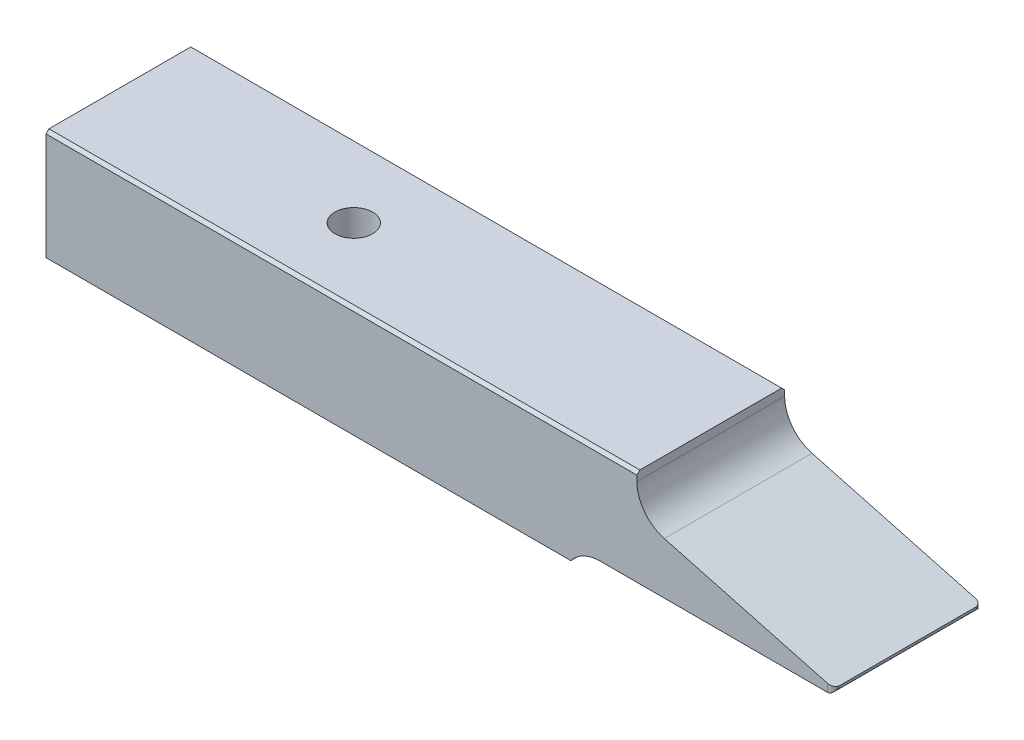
ISO-10303-21;
HEADER;
FILE_DESCRIPTION(('STEP AP214'),'2;1');
FILE_NAME('part.step','',(''),(''),'','','');
FILE_SCHEMA(('AUTOMOTIVE_DESIGN { 1 0 10303 214 1 1 1 1 }'));
ENDSEC;
DATA;
#1=APPLICATION_CONTEXT('core data for automotive mechanical design processes');
#2=APPLICATION_PROTOCOL_DEFINITION('international standard','automotive_design',2000,#1);
#3=PRODUCT_CONTEXT('',#1,'mechanical');
#4=PRODUCT('Part','Part','',(#3));
#5=PRODUCT_RELATED_PRODUCT_CATEGORY('part','',(#4));
#6=PRODUCT_DEFINITION_FORMATION('','',#4);
#7=PRODUCT_DEFINITION_CONTEXT('part definition',#1,'design');
#8=PRODUCT_DEFINITION('design','',#6,#7);
#9=PRODUCT_DEFINITION_SHAPE('','',#8);
#10=(LENGTH_UNIT() NAMED_UNIT(*) SI_UNIT(.MILLI.,.METRE.));
#11=(NAMED_UNIT(*) PLANE_ANGLE_UNIT() SI_UNIT($,.RADIAN.));
#12=(NAMED_UNIT(*) SI_UNIT($,.STERADIAN.) SOLID_ANGLE_UNIT());
#13=UNCERTAINTY_MEASURE_WITH_UNIT(LENGTH_MEASURE(1.E-05),#10,'distance_accuracy_value','');
#14=(GEOMETRIC_REPRESENTATION_CONTEXT(3) GLOBAL_UNCERTAINTY_ASSIGNED_CONTEXT((#13)) GLOBAL_UNIT_ASSIGNED_CONTEXT((#10,
#11,#12)) REPRESENTATION_CONTEXT('',''));
#15=CARTESIAN_POINT('',(0.,0.,0.));
#16=DIRECTION('',(0.,0.,1.));
#17=DIRECTION('',(1.,0.,0.));
#18=AXIS2_PLACEMENT_3D('',#15,#16,#17);
#19=CARTESIAN_POINT('',(101.6,2.63525,-9.525));
#20=DIRECTION('',(0.258819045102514,0.96592582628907,0.));
#21=DIRECTION('',(-0.96592582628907,0.258819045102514,0.));
#22=AXIS2_PLACEMENT_3D('',#19,#20,#21);
#23=PLANE('',#22);
#24=DIRECTION('',(0.,0.,1.));
#25=VECTOR('',#24,1.);
#26=CARTESIAN_POINT('',(101.6,2.63525,-9.525));
#27=LINE('',#26,#25);
#28=CARTESIAN_POINT('',(101.6,2.63525,-8.73124999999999));
#29=VERTEX_POINT('',#28);
#30=CARTESIAN_POINT('',(101.6,2.63525,8.73124999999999));
#31=VERTEX_POINT('',#30);
#32=EDGE_CURVE('E146',#29,#31,#27,.T.);
#33=ORIENTED_EDGE('',*,*,#32,.F.);
#34=CARTESIAN_POINT('',(100.80625,2.8479346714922,-8.73125));
#35=DIRECTION('',(0.258819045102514,0.96592582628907,0.));
#36=DIRECTION('',(0.96592582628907,-0.258819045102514,0.));
#37=AXIS2_PLACEMENT_3D('',#34,#35,#36);
#38=ELLIPSE('',#37,0.8217504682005,0.793749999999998);
#39=CARTESIAN_POINT('',(100.80625,2.84793467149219,-9.525));
#40=VERTEX_POINT('',#39);
#41=EDGE_CURVE('E260',#29,#40,#38,.T.);
#42=ORIENTED_EDGE('',*,*,#41,.T.);
#43=DIRECTION('',(-0.96592582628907,0.258819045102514,0.));
#44=VECTOR('',#43,1.);
#45=CARTESIAN_POINT('',(101.6,2.63525,-9.525));
#46=LINE('',#45,#44);
#47=CARTESIAN_POINT('',(79.7298742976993,8.49533252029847,-9.525));
#48=VERTEX_POINT('',#47);
#49=EDGE_CURVE('E218',#40,#48,#46,.T.);
#50=ORIENTED_EDGE('',*,*,#49,.T.);
#51=DIRECTION('',(0.,0.,1.));
#52=VECTOR('',#51,1.);
#53=CARTESIAN_POINT('',(79.7298742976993,8.49533252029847,-9.525));
#54=LINE('',#53,#52);
#55=CARTESIAN_POINT('',(79.7298742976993,8.49533252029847,9.525));
#56=VERTEX_POINT('',#55);
#57=EDGE_CURVE('E154',#48,#56,#54,.T.);
#58=ORIENTED_EDGE('',*,*,#57,.T.);
#59=DIRECTION('',(-0.96592582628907,0.258819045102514,0.));
#60=VECTOR('',#59,1.);
#61=CARTESIAN_POINT('',(101.6,2.63525,9.525));
#62=LINE('',#61,#60);
#63=CARTESIAN_POINT('',(100.80625,2.84793467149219,9.525));
#64=VERTEX_POINT('',#63);
#65=EDGE_CURVE('E134',#64,#56,#62,.T.);
#66=ORIENTED_EDGE('',*,*,#65,.F.);
#67=CARTESIAN_POINT('',(100.80625,2.8479346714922,8.73125));
#68=DIRECTION('',(0.258819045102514,0.96592582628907,0.));
#69=DIRECTION('',(0.96592582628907,-0.258819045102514,0.));
#70=AXIS2_PLACEMENT_3D('',#67,#68,#69);
#71=ELLIPSE('',#70,0.8217504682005,0.793749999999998);
#72=EDGE_CURVE('E49',#64,#31,#71,.T.);
#73=ORIENTED_EDGE('',*,*,#72,.T.);
#74=EDGE_LOOP('',(#33,#42,#50,#58,#66,#73));
#75=FACE_BOUND('',#74,.T.);
#76=ADVANCED_FACE('F34',(#75),#23,.T.);
#77=CARTESIAN_POINT('',(100.80625,2.63525,-9.525));
#78=DIRECTION('',(0.,0.,1.));
#79=DIRECTION('',(1.,0.,0.));
#80=AXIS2_PLACEMENT_3D('',#77,#78,#79);
#81=CYLINDRICAL_SURFACE('',#80,0.793749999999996);
#82=DIRECTION('',(0.,0.,1.));
#83=VECTOR('',#82,1.);
#84=CARTESIAN_POINT('',(100.80625,1.8415,-9.525));
#85=LINE('',#84,#83);
#86=CARTESIAN_POINT('',(100.80625,1.8415,-9.525));
#87=VERTEX_POINT('',#86);
#88=CARTESIAN_POINT('',(100.80625,1.8415,9.525));
#89=VERTEX_POINT('',#88);
#90=EDGE_CURVE('E144',#87,#89,#85,.T.);
#91=ORIENTED_EDGE('',*,*,#90,.F.);
#92=CARTESIAN_POINT('',(100.80625,2.63525,-8.73125));
#93=DIRECTION('',(0.,-0.707106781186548,0.707106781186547));
#94=DIRECTION('',(0.,0.707106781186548,0.707106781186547));
#95=AXIS2_PLACEMENT_3D('',#92,#93,#94);
#96=ELLIPSE('',#95,1.12253201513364,0.793749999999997);
#97=EDGE_CURVE('E262',#87,#29,#96,.T.);
#98=ORIENTED_EDGE('',*,*,#97,.T.);
#99=ORIENTED_EDGE('',*,*,#32,.T.);
#100=CARTESIAN_POINT('',(100.80625,2.63525,8.73125));
#101=DIRECTION('',(0.,0.707106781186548,0.707106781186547));
#102=DIRECTION('',(0.,-0.707106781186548,0.707106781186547));
#103=AXIS2_PLACEMENT_3D('',#100,#101,#102);
#104=ELLIPSE('',#103,1.12253201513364,0.793749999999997);
#105=EDGE_CURVE('E138',#31,#89,#104,.F.);
#106=ORIENTED_EDGE('',*,*,#105,.T.);
#107=EDGE_LOOP('',(#91,#98,#99,#106));
#108=FACE_BOUND('',#107,.T.);
#109=ADVANCED_FACE('F142',(#108),#81,.T.);
#110=CARTESIAN_POINT('',(80.9625,13.0955542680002,-9.525));
#111=DIRECTION('',(0.,0.,-1.));
#112=DIRECTION('',(-1.,0.,0.));
#113=AXIS2_PLACEMENT_3D('',#110,#111,#112);
#114=PLANE('',#113);
#115=DIRECTION('',(0.,-1.,0.));
#116=VECTOR('',#115,1.);
#117=CARTESIAN_POINT('',(100.80625,14.1986,-9.525));
#118=LINE('',#117,#116);
#119=EDGE_CURVE('E11',#40,#87,#118,.T.);
#120=ORIENTED_EDGE('',*,*,#119,.T.);
#121=DIRECTION('',(1.,0.,0.));
#122=VECTOR('',#121,1.);
#123=CARTESIAN_POINT('',(71.4375,1.8415,-9.525));
#124=LINE('',#123,#122);
#125=CARTESIAN_POINT('',(71.4375,1.8415,-9.525));
#126=VERTEX_POINT('',#125);
#127=EDGE_CURVE('E150',#126,#87,#124,.T.);
#128=ORIENTED_EDGE('',*,*,#127,.F.);
#129=CARTESIAN_POINT('',(71.4375,-2.921,-9.525));
#130=DIRECTION('',(0.,0.,-1.));
#131=DIRECTION('',(1.,0.,0.));
#132=AXIS2_PLACEMENT_3D('',#129,#130,#131);
#133=CIRCLE('',#132,4.7625);
#134=CARTESIAN_POINT('',(67.6759623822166,0.,-9.525));
#135=VERTEX_POINT('',#134);
#136=EDGE_CURVE('E227',#135,#126,#133,.T.);
#137=ORIENTED_EDGE('',*,*,#136,.F.);
#138=DIRECTION('',(1.,0.,0.));
#139=VECTOR('',#138,1.);
#140=CARTESIAN_POINT('',(67.6759623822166,0.,-9.525));
#141=LINE('',#140,#139);
#142=CARTESIAN_POINT('',(0.,0.,-9.525));
#143=VERTEX_POINT('',#142);
#144=EDGE_CURVE('E225',#143,#135,#141,.T.);
#145=ORIENTED_EDGE('',*,*,#144,.F.);
#146=DIRECTION('',(0.,-1.,0.));
#147=VECTOR('',#146,1.);
#148=CARTESIAN_POINT('',(0.,0.,-9.525));
#149=LINE('',#148,#147);
#150=CARTESIAN_POINT('',(0.,13.8176,-9.525));
#151=VERTEX_POINT('',#150);
#152=EDGE_CURVE('E161',#151,#143,#149,.T.);
#153=ORIENTED_EDGE('',*,*,#152,.F.);
#154=DIRECTION('',(1.,0.,0.));
#155=VECTOR('',#154,1.);
#156=CARTESIAN_POINT('',(80.9625,13.8176,-9.525));
#157=LINE('',#156,#155);
#158=CARTESIAN_POINT('',(76.2,13.8176,-9.525));
#159=VERTEX_POINT('',#158);
#160=EDGE_CURVE('E57',#151,#159,#157,.T.);
#161=ORIENTED_EDGE('',*,*,#160,.T.);
#162=DIRECTION('',(0.,1.,0.));
#163=VECTOR('',#162,1.);
#164=CARTESIAN_POINT('',(76.2,14.1986,-9.525));
#165=LINE('',#164,#163);
#166=CARTESIAN_POINT('',(76.2,13.0955542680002,-9.525));
#167=VERTEX_POINT('',#166);
#168=EDGE_CURVE('E242',#167,#159,#165,.T.);
#169=ORIENTED_EDGE('',*,*,#168,.F.);
#170=CARTESIAN_POINT('',(80.9625,13.0955542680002,-9.525));
#171=DIRECTION('',(0.,0.,-1.));
#172=DIRECTION('',(-1.,0.,0.));
#173=AXIS2_PLACEMENT_3D('',#170,#171,#172);
#174=CIRCLE('',#173,4.76249999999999);
#175=EDGE_CURVE('E240',#48,#167,#174,.T.);
#176=ORIENTED_EDGE('',*,*,#175,.F.);
#177=ORIENTED_EDGE('',*,*,#49,.F.);
#178=EDGE_LOOP('',(#120,#128,#137,#145,#153,#161,#169,#176,#177));
#179=FACE_BOUND('',#178,.T.);
#180=ADVANCED_FACE('F265',(#179),#114,.T.);
#181=CARTESIAN_POINT('',(80.9625,13.0955542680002,9.525));
#182=DIRECTION('',(0.,0.,-1.));
#183=DIRECTION('',(-1.,0.,0.));
#184=AXIS2_PLACEMENT_3D('',#181,#182,#183);
#185=PLANE('',#184);
#186=ORIENTED_EDGE('',*,*,#65,.T.);
#187=CARTESIAN_POINT('',(80.9625,13.0955542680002,9.525));
#188=DIRECTION('',(0.,0.,-1.));
#189=DIRECTION('',(-1.,0.,0.));
#190=AXIS2_PLACEMENT_3D('',#187,#188,#189);
#191=CIRCLE('',#190,4.76249999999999);
#192=CARTESIAN_POINT('',(76.2,13.0955542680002,9.525));
#193=VERTEX_POINT('',#192);
#194=EDGE_CURVE('E194',#56,#193,#191,.T.);
#195=ORIENTED_EDGE('',*,*,#194,.T.);
#196=DIRECTION('',(0.,1.,0.));
#197=VECTOR('',#196,1.);
#198=CARTESIAN_POINT('',(76.2,14.1986,9.525));
#199=LINE('',#198,#197);
#200=CARTESIAN_POINT('',(76.2,13.8176,9.525));
#201=VERTEX_POINT('',#200);
#202=EDGE_CURVE('E185',#193,#201,#199,.T.);
#203=ORIENTED_EDGE('',*,*,#202,.T.);
#204=DIRECTION('',(-1.,0.,0.));
#205=VECTOR('',#204,1.);
#206=CARTESIAN_POINT('',(0.,13.8176,9.525));
#207=LINE('',#206,#205);
#208=CARTESIAN_POINT('',(0.,13.8176,9.525));
#209=VERTEX_POINT('',#208);
#210=EDGE_CURVE('E162',#201,#209,#207,.T.);
#211=ORIENTED_EDGE('',*,*,#210,.T.);
#212=DIRECTION('',(0.,-1.,0.));
#213=VECTOR('',#212,1.);
#214=CARTESIAN_POINT('',(0.,0.,9.525));
#215=LINE('',#214,#213);
#216=CARTESIAN_POINT('',(0.,0.,9.525));
#217=VERTEX_POINT('',#216);
#218=EDGE_CURVE('E195',#209,#217,#215,.T.);
#219=ORIENTED_EDGE('',*,*,#218,.T.);
#220=DIRECTION('',(1.,0.,0.));
#221=VECTOR('',#220,1.);
#222=CARTESIAN_POINT('',(67.6759623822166,0.,9.525));
#223=LINE('',#222,#221);
#224=CARTESIAN_POINT('',(67.6759623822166,0.,9.525));
#225=VERTEX_POINT('',#224);
#226=EDGE_CURVE('E245',#217,#225,#223,.T.);
#227=ORIENTED_EDGE('',*,*,#226,.T.);
#228=CARTESIAN_POINT('',(71.4375,-2.921,9.525));
#229=DIRECTION('',(0.,0.,-1.));
#230=DIRECTION('',(1.,0.,0.));
#231=AXIS2_PLACEMENT_3D('',#228,#229,#230);
#232=CIRCLE('',#231,4.7625);
#233=CARTESIAN_POINT('',(71.4375,1.8415,9.525));
#234=VERTEX_POINT('',#233);
#235=EDGE_CURVE('E131',#225,#234,#232,.T.);
#236=ORIENTED_EDGE('',*,*,#235,.T.);
#237=DIRECTION('',(1.,0.,0.));
#238=VECTOR('',#237,1.);
#239=CARTESIAN_POINT('',(71.4375,1.8415,9.525));
#240=LINE('',#239,#238);
#241=EDGE_CURVE('E126',#234,#89,#240,.T.);
#242=ORIENTED_EDGE('',*,*,#241,.T.);
#243=DIRECTION('',(0.,-1.,0.));
#244=VECTOR('',#243,1.);
#245=CARTESIAN_POINT('',(100.80625,14.1986,9.525));
#246=LINE('',#245,#244);
#247=EDGE_CURVE('E42',#64,#89,#246,.T.);
#248=ORIENTED_EDGE('',*,*,#247,.F.);
#249=EDGE_LOOP('',(#186,#195,#203,#211,#219,#227,#236,#242,#248));
#250=FACE_BOUND('',#249,.T.);
#251=ADVANCED_FACE('F127',(#250),#185,.F.);
#252=CARTESIAN_POINT('',(67.6759623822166,0.,-9.525));
#253=DIRECTION('',(0.,-1.,0.));
#254=DIRECTION('',(0.,0.,-1.));
#255=AXIS2_PLACEMENT_3D('',#252,#253,#254);
#256=PLANE('',#255);
#257=CARTESIAN_POINT('',(30.1625,0.,0.));
#258=DIRECTION('',(0.,-1.,0.));
#259=DIRECTION('',(0.,0.,-1.));
#260=AXIS2_PLACEMENT_3D('',#257,#258,#259);
#261=CIRCLE('',#260,2.0193);
#262=CARTESIAN_POINT('',(30.1625,0.,-2.0193));
#263=VERTEX_POINT('',#262);
#264=EDGE_CURVE('E253',#263,#263,#261,.T.);
#265=ORIENTED_EDGE('',*,*,#264,.F.);
#266=EDGE_LOOP('',(#265));
#267=FACE_BOUND('',#266,.T.);
#268=ORIENTED_EDGE('',*,*,#226,.F.);
#269=DIRECTION('',(0.,0.,1.));
#270=VECTOR('',#269,1.);
#271=CARTESIAN_POINT('',(0.,0.,-9.525));
#272=LINE('',#271,#270);
#273=EDGE_CURVE('E166',#143,#217,#272,.T.);
#274=ORIENTED_EDGE('',*,*,#273,.F.);
#275=ORIENTED_EDGE('',*,*,#144,.T.);
#276=DIRECTION('',(0.,0.,1.));
#277=VECTOR('',#276,1.);
#278=CARTESIAN_POINT('',(67.6759623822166,0.,-9.525));
#279=LINE('',#278,#277);
#280=EDGE_CURVE('E156',#135,#225,#279,.T.);
#281=ORIENTED_EDGE('',*,*,#280,.T.);
#282=EDGE_LOOP('',(#268,#274,#275,#281));
#283=FACE_BOUND('',#282,.T.);
#284=ADVANCED_FACE('F271',(#267,#283),#256,.T.);
#285=CARTESIAN_POINT('',(0.,0.,-9.525));
#286=DIRECTION('',(-1.,0.,0.));
#287=DIRECTION('',(0.,0.,1.));
#288=AXIS2_PLACEMENT_3D('',#285,#286,#287);
#289=PLANE('',#288);
#290=ORIENTED_EDGE('',*,*,#218,.F.);
#291=DIRECTION('',(0.,0.707106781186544,-0.707106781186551));
#292=VECTOR('',#291,1.);
#293=CARTESIAN_POINT('',(0.,16.4338000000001,6.90879999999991));
#294=LINE('',#293,#292);
#295=CARTESIAN_POINT('',(0.,14.1986,9.14399999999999));
#296=VERTEX_POINT('',#295);
#297=EDGE_CURVE('E168',#209,#296,#294,.T.);
#298=ORIENTED_EDGE('',*,*,#297,.T.);
#299=DIRECTION('',(0.,0.,1.));
#300=VECTOR('',#299,1.);
#301=CARTESIAN_POINT('',(0.,14.1986,-9.525));
#302=LINE('',#301,#300);
#303=CARTESIAN_POINT('',(0.,14.1986,-9.14399999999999));
#304=VERTEX_POINT('',#303);
#305=EDGE_CURVE('E202',#304,#296,#302,.T.);
#306=ORIENTED_EDGE('',*,*,#305,.F.);
#307=DIRECTION('',(0.,0.707106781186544,0.707106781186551));
#308=VECTOR('',#307,1.);
#309=CARTESIAN_POINT('',(0.,6.90880000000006,-16.4338));
#310=LINE('',#309,#308);
#311=EDGE_CURVE('E165',#304,#151,#310,.F.);
#312=ORIENTED_EDGE('',*,*,#311,.T.);
#313=ORIENTED_EDGE('',*,*,#152,.T.);
#314=ORIENTED_EDGE('',*,*,#273,.T.);
#315=EDGE_LOOP('',(#290,#298,#306,#312,#313,#314));
#316=FACE_BOUND('',#315,.T.);
#317=ADVANCED_FACE('F201',(#316),#289,.T.);
#318=CARTESIAN_POINT('',(0.,14.1986,-9.525));
#319=DIRECTION('',(0.,1.,0.));
#320=DIRECTION('',(0.,0.,1.));
#321=AXIS2_PLACEMENT_3D('',#318,#319,#320);
#322=PLANE('',#321);
#323=CARTESIAN_POINT('',(30.1625,14.1986,0.));
#324=DIRECTION('',(0.,1.,0.));
#325=DIRECTION('',(0.,0.,1.));
#326=AXIS2_PLACEMENT_3D('',#323,#324,#325);
#327=CIRCLE('',#326,2.43205);
#328=CARTESIAN_POINT('',(30.1625,14.1986,2.43205));
#329=VERTEX_POINT('',#328);
#330=EDGE_CURVE('E235',#329,#329,#327,.T.);
#331=ORIENTED_EDGE('',*,*,#330,.F.);
#332=EDGE_LOOP('',(#331));
#333=FACE_BOUND('',#332,.T.);
#334=ORIENTED_EDGE('',*,*,#305,.T.);
#335=DIRECTION('',(1.,0.,0.));
#336=VECTOR('',#335,1.);
#337=CARTESIAN_POINT('',(76.2,14.1986,9.14399999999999));
#338=LINE('',#337,#336);
#339=CARTESIAN_POINT('',(76.2,14.1986,9.14399999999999));
#340=VERTEX_POINT('',#339);
#341=EDGE_CURVE('E173',#296,#340,#338,.T.);
#342=ORIENTED_EDGE('',*,*,#341,.T.);
#343=DIRECTION('',(0.,0.,1.));
#344=VECTOR('',#343,1.);
#345=CARTESIAN_POINT('',(76.2,14.1986,-9.525));
#346=LINE('',#345,#344);
#347=CARTESIAN_POINT('',(76.2,14.1986,-9.14399999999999));
#348=VERTEX_POINT('',#347);
#349=EDGE_CURVE('E188',#348,#340,#346,.T.);
#350=ORIENTED_EDGE('',*,*,#349,.F.);
#351=DIRECTION('',(-1.,0.,0.));
#352=VECTOR('',#351,1.);
#353=CARTESIAN_POINT('',(0.,14.1986,-9.14399999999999));
#354=LINE('',#353,#352);
#355=EDGE_CURVE('E170',#348,#304,#354,.T.);
#356=ORIENTED_EDGE('',*,*,#355,.T.);
#357=EDGE_LOOP('',(#334,#342,#350,#356));
#358=FACE_BOUND('',#357,.T.);
#359=ADVANCED_FACE('F205',(#333,#358),#322,.T.);
#360=CARTESIAN_POINT('',(76.2,14.1986,-9.525));
#361=DIRECTION('',(1.,0.,0.));
#362=DIRECTION('',(0.,0.,-1.));
#363=AXIS2_PLACEMENT_3D('',#360,#361,#362);
#364=PLANE('',#363);
#365=ORIENTED_EDGE('',*,*,#349,.T.);
#366=DIRECTION('',(0.,-0.707106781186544,0.707106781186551));
#367=VECTOR('',#366,1.);
#368=CARTESIAN_POINT('',(76.2,23.5331,-0.190500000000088));
#369=LINE('',#368,#367);
#370=EDGE_CURVE('E177',#340,#201,#369,.T.);
#371=ORIENTED_EDGE('',*,*,#370,.T.);
#372=ORIENTED_EDGE('',*,*,#202,.F.);
#373=DIRECTION('',(0.,0.,1.));
#374=VECTOR('',#373,1.);
#375=CARTESIAN_POINT('',(76.2,13.0955542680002,-9.525));
#376=LINE('',#375,#374);
#377=EDGE_CURVE('E209',#167,#193,#376,.T.);
#378=ORIENTED_EDGE('',*,*,#377,.F.);
#379=ORIENTED_EDGE('',*,*,#168,.T.);
#380=DIRECTION('',(0.,-0.707106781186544,-0.707106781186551));
#381=VECTOR('',#380,1.);
#382=CARTESIAN_POINT('',(76.2,14.0081,-9.3345));
#383=LINE('',#382,#381);
#384=EDGE_CURVE('E175',#159,#348,#383,.F.);
#385=ORIENTED_EDGE('',*,*,#384,.T.);
#386=EDGE_LOOP('',(#365,#371,#372,#378,#379,#385));
#387=FACE_BOUND('',#386,.T.);
#388=ADVANCED_FACE('F184',(#387),#364,.T.);
#389=CARTESIAN_POINT('',(80.9625,13.0955542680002,-9.525));
#390=DIRECTION('',(0.,0.,1.));
#391=DIRECTION('',(1.,0.,0.));
#392=AXIS2_PLACEMENT_3D('',#389,#390,#391);
#393=CYLINDRICAL_SURFACE('',#392,4.76249999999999);
#394=ORIENTED_EDGE('',*,*,#194,.F.);
#395=ORIENTED_EDGE('',*,*,#57,.F.);
#396=ORIENTED_EDGE('',*,*,#175,.T.);
#397=ORIENTED_EDGE('',*,*,#377,.T.);
#398=EDGE_LOOP('',(#394,#395,#396,#397));
#399=FACE_BOUND('',#398,.T.);
#400=ADVANCED_FACE('F222',(#399),#393,.F.);
#401=CARTESIAN_POINT('',(71.4375,1.8415,-9.525));
#402=DIRECTION('',(0.,-1.,0.));
#403=DIRECTION('',(0.,0.,-1.));
#404=AXIS2_PLACEMENT_3D('',#401,#402,#403);
#405=PLANE('',#404);
#406=ORIENTED_EDGE('',*,*,#241,.F.);
#407=DIRECTION('',(0.,0.,1.));
#408=VECTOR('',#407,1.);
#409=CARTESIAN_POINT('',(71.4375,1.8415,-9.525));
#410=LINE('',#409,#408);
#411=EDGE_CURVE('E152',#126,#234,#410,.T.);
#412=ORIENTED_EDGE('',*,*,#411,.F.);
#413=ORIENTED_EDGE('',*,*,#127,.T.);
#414=ORIENTED_EDGE('',*,*,#90,.T.);
#415=EDGE_LOOP('',(#406,#412,#413,#414));
#416=FACE_BOUND('',#415,.T.);
#417=ADVANCED_FACE('F148',(#416),#405,.T.);
#418=CARTESIAN_POINT('',(71.4375,-2.921,-9.525));
#419=DIRECTION('',(0.,0.,1.));
#420=DIRECTION('',(1.,0.,0.));
#421=AXIS2_PLACEMENT_3D('',#418,#419,#420);
#422=CYLINDRICAL_SURFACE('',#421,4.7625);
#423=ORIENTED_EDGE('',*,*,#235,.F.);
#424=ORIENTED_EDGE('',*,*,#280,.F.);
#425=ORIENTED_EDGE('',*,*,#136,.T.);
#426=ORIENTED_EDGE('',*,*,#411,.T.);
#427=EDGE_LOOP('',(#423,#424,#425,#426));
#428=FACE_BOUND('',#427,.T.);
#429=ADVANCED_FACE('F270',(#428),#422,.F.);
#430=CARTESIAN_POINT('',(80.9625,13.8176,9.525));
#431=DIRECTION('',(0.,0.707106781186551,0.707106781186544));
#432=DIRECTION('',(0.,-0.707106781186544,0.707106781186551));
#433=AXIS2_PLACEMENT_3D('',#430,#431,#432);
#434=PLANE('',#433);
#435=ORIENTED_EDGE('',*,*,#370,.F.);
#436=ORIENTED_EDGE('',*,*,#341,.F.);
#437=ORIENTED_EDGE('',*,*,#297,.F.);
#438=ORIENTED_EDGE('',*,*,#210,.F.);
#439=EDGE_LOOP('',(#435,#436,#437,#438));
#440=FACE_BOUND('',#439,.T.);
#441=ADVANCED_FACE('F197',(#440),#434,.T.);
#442=CARTESIAN_POINT('',(0.,14.1986,-9.14399999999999));
#443=DIRECTION('',(0.,-0.707106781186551,0.707106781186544));
#444=DIRECTION('',(0.,-0.707106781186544,-0.707106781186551));
#445=AXIS2_PLACEMENT_3D('',#442,#443,#444);
#446=PLANE('',#445);
#447=ORIENTED_EDGE('',*,*,#384,.F.);
#448=ORIENTED_EDGE('',*,*,#160,.F.);
#449=ORIENTED_EDGE('',*,*,#311,.F.);
#450=ORIENTED_EDGE('',*,*,#355,.F.);
#451=EDGE_LOOP('',(#447,#448,#449,#450));
#452=FACE_BOUND('',#451,.T.);
#453=ADVANCED_FACE('F36',(#452),#446,.F.);
#454=CARTESIAN_POINT('',(30.1625,7.8486,0.));
#455=DIRECTION('',(0.,1.,0.));
#456=DIRECTION('',(0.,0.,1.));
#457=AXIS2_PLACEMENT_3D('',#454,#455,#456);
#458=CYLINDRICAL_SURFACE('',#457,2.43205);
#459=CARTESIAN_POINT('',(30.1625,7.8486,0.));
#460=DIRECTION('',(0.,1.,0.));
#461=DIRECTION('',(0.,0.,1.));
#462=AXIS2_PLACEMENT_3D('',#459,#460,#461);
#463=CIRCLE('',#462,2.43205);
#464=CARTESIAN_POINT('',(30.1625,7.8486,2.43205));
#465=VERTEX_POINT('',#464);
#466=EDGE_CURVE('E247',#465,#465,#463,.T.);
#467=ORIENTED_EDGE('',*,*,#466,.F.);
#468=EDGE_LOOP('',(#467));
#469=FACE_BOUND('',#468,.T.);
#470=ORIENTED_EDGE('',*,*,#330,.T.);
#471=EDGE_LOOP('',(#470));
#472=FACE_BOUND('',#471,.T.);
#473=ADVANCED_FACE('F300',(#469,#472),#458,.F.);
#474=CARTESIAN_POINT('',(30.1625,7.8486,0.));
#475=DIRECTION('',(0.,1.,0.));
#476=DIRECTION('',(0.,0.,1.));
#477=AXIS2_PLACEMENT_3D('',#474,#475,#476);
#478=PLANE('',#477);
#479=CARTESIAN_POINT('',(30.1625,7.84859999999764,0.));
#480=DIRECTION('',(0.,1.,0.));
#481=DIRECTION('',(0.,0.,1.));
#482=AXIS2_PLACEMENT_3D('',#479,#480,#481);
#483=CIRCLE('',#482,2.0193);
#484=CARTESIAN_POINT('',(30.1625,7.84859999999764,2.0193));
#485=VERTEX_POINT('',#484);
#486=EDGE_CURVE('E257',#485,#485,#483,.T.);
#487=ORIENTED_EDGE('',*,*,#486,.F.);
#488=EDGE_LOOP('',(#487));
#489=FACE_BOUND('',#488,.T.);
#490=ORIENTED_EDGE('',*,*,#466,.T.);
#491=EDGE_LOOP('',(#490));
#492=FACE_BOUND('',#491,.T.);
#493=ADVANCED_FACE('F304',(#489,#492),#478,.T.);
#494=CARTESIAN_POINT('',(30.1625,7.84859999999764,0.));
#495=DIRECTION('',(0.,1.,0.));
#496=DIRECTION('',(0.,0.,1.));
#497=AXIS2_PLACEMENT_3D('',#494,#495,#496);
#498=CYLINDRICAL_SURFACE('',#497,2.0193);
#499=ORIENTED_EDGE('',*,*,#264,.T.);
#500=EDGE_LOOP('',(#499));
#501=FACE_BOUND('',#500,.T.);
#502=ORIENTED_EDGE('',*,*,#486,.T.);
#503=EDGE_LOOP('',(#502));
#504=FACE_BOUND('',#503,.T.);
#505=ADVANCED_FACE('F310',(#501,#504),#498,.F.);
#506=CARTESIAN_POINT('',(100.80625,14.1986,8.73125));
#507=DIRECTION('',(0.,-1.,0.));
#508=DIRECTION('',(0.,0.,-1.));
#509=AXIS2_PLACEMENT_3D('',#506,#507,#508);
#510=CYLINDRICAL_SURFACE('',#509,0.793749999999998);
#511=ORIENTED_EDGE('',*,*,#247,.T.);
#512=ORIENTED_EDGE('',*,*,#105,.F.);
#513=ORIENTED_EDGE('',*,*,#72,.F.);
#514=EDGE_LOOP('',(#511,#512,#513));
#515=FACE_BOUND('',#514,.T.);
#516=ADVANCED_FACE('F137',(#515),#510,.T.);
#517=CARTESIAN_POINT('',(100.80625,14.1986,-8.73125));
#518=DIRECTION('',(0.,-1.,0.));
#519=DIRECTION('',(0.,0.,-1.));
#520=AXIS2_PLACEMENT_3D('',#517,#518,#519);
#521=CYLINDRICAL_SURFACE('',#520,0.793749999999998);
#522=ORIENTED_EDGE('',*,*,#97,.F.);
#523=ORIENTED_EDGE('',*,*,#119,.F.);
#524=ORIENTED_EDGE('',*,*,#41,.F.);
#525=EDGE_LOOP('',(#522,#523,#524));
#526=FACE_BOUND('',#525,.T.);
#527=ADVANCED_FACE('F344',(#526),#521,.T.);
#528=CLOSED_SHELL('',(#76,#109,#180,#251,#284,#317,#359,#388,#400,#417,#429,#441,#453,#473,#493,
#505,#516,#527));
#529=MANIFOLD_SOLID_BREP('B2',#528);
#530=ADVANCED_BREP_SHAPE_REPRESENTATION('',(#18,#529),#14);
#531=SHAPE_DEFINITION_REPRESENTATION(#9,#530);
ENDSEC;
END-ISO-10303-21;
